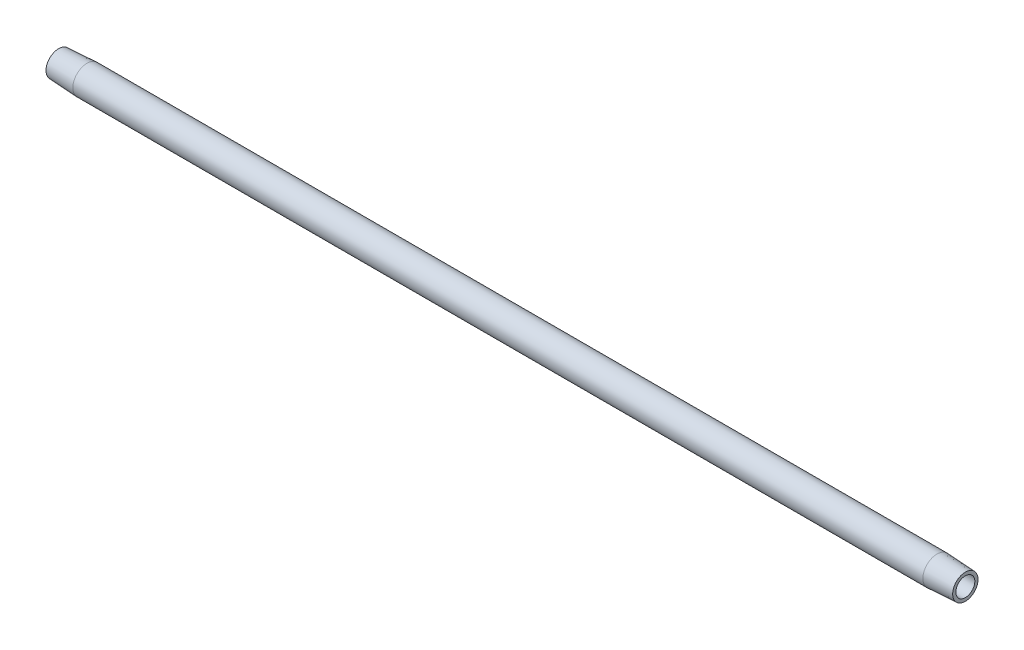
ISO-10303-21;
HEADER;
FILE_DESCRIPTION(('STEP AP214'),'2;1');
FILE_NAME('part.step','',(''),(''),'','','');
FILE_SCHEMA(('AUTOMOTIVE_DESIGN { 1 0 10303 214 1 1 1 1 }'));
ENDSEC;
DATA;
#1=APPLICATION_CONTEXT('core data for automotive mechanical design processes');
#2=APPLICATION_PROTOCOL_DEFINITION('international standard','automotive_design',2000,#1);
#3=PRODUCT_CONTEXT('',#1,'mechanical');
#4=PRODUCT('Part','Part','',(#3));
#5=PRODUCT_RELATED_PRODUCT_CATEGORY('part','',(#4));
#6=PRODUCT_DEFINITION_FORMATION('','',#4);
#7=PRODUCT_DEFINITION_CONTEXT('part definition',#1,'design');
#8=PRODUCT_DEFINITION('design','',#6,#7);
#9=PRODUCT_DEFINITION_SHAPE('','',#8);
#10=(LENGTH_UNIT() NAMED_UNIT(*) SI_UNIT(.MILLI.,.METRE.));
#11=(NAMED_UNIT(*) PLANE_ANGLE_UNIT() SI_UNIT($,.RADIAN.));
#12=(NAMED_UNIT(*) SI_UNIT($,.STERADIAN.) SOLID_ANGLE_UNIT());
#13=UNCERTAINTY_MEASURE_WITH_UNIT(LENGTH_MEASURE(1.E-05),#10,'distance_accuracy_value','');
#14=(GEOMETRIC_REPRESENTATION_CONTEXT(3) GLOBAL_UNCERTAINTY_ASSIGNED_CONTEXT((#13)) GLOBAL_UNIT_ASSIGNED_CONTEXT((#10,
#11,#12)) REPRESENTATION_CONTEXT('',''));
#15=CARTESIAN_POINT('',(0.,0.,0.));
#16=DIRECTION('',(0.,0.,1.));
#17=DIRECTION('',(1.,0.,0.));
#18=AXIS2_PLACEMENT_3D('',#15,#16,#17);
#19=CARTESIAN_POINT('',(0.476141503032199,0.,0.));
#20=DIRECTION('',(-1.,0.,0.));
#21=DIRECTION('',(0.,0.,1.));
#22=AXIS2_PLACEMENT_3D('',#19,#20,#21);
#23=CYLINDRICAL_SURFACE('',#22,3.96875);
#24=CARTESIAN_POINT('',(7.9375,0.,0.));
#25=DIRECTION('',(-1.,0.,0.));
#26=DIRECTION('',(0.,0.,1.));
#27=AXIS2_PLACEMENT_3D('',#24,#25,#26);
#28=CIRCLE('',#27,3.96875);
#29=CARTESIAN_POINT('',(7.9375,0.,3.96875));
#30=VERTEX_POINT('',#29);
#31=EDGE_CURVE('E10',#30,#30,#28,.T.);
#32=ORIENTED_EDGE('',*,*,#31,.F.);
#33=EDGE_LOOP('',(#32));
#34=FACE_BOUND('',#33,.T.);
#35=CARTESIAN_POINT('',(246.0625,0.,0.));
#36=DIRECTION('',(-1.,0.,0.));
#37=DIRECTION('',(0.,0.,1.));
#38=AXIS2_PLACEMENT_3D('',#35,#36,#37);
#39=CIRCLE('',#38,3.96875);
#40=CARTESIAN_POINT('',(246.0625,0.,3.96875));
#41=VERTEX_POINT('',#40);
#42=EDGE_CURVE('E52',#41,#41,#39,.T.);
#43=ORIENTED_EDGE('',*,*,#42,.T.);
#44=EDGE_LOOP('',(#43));
#45=FACE_BOUND('',#44,.T.);
#46=ADVANCED_FACE('F30',(#34,#45),#23,.T.);
#47=CARTESIAN_POINT('',(7.9375,0.,0.));
#48=DIRECTION('',(1.,0.,0.));
#49=DIRECTION('',(0.,0.,-1.));
#50=AXIS2_PLACEMENT_3D('',#47,#48,#49);
#51=CONICAL_SURFACE('',#50,3.96875,0.0523598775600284);
#52=CARTESIAN_POINT('',(0.,0.,0.));
#53=DIRECTION('',(-1.,0.,0.));
#54=DIRECTION('',(0.,0.,1.));
#55=AXIS2_PLACEMENT_3D('',#52,#53,#54);
#56=CIRCLE('',#55,3.55276325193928);
#57=CARTESIAN_POINT('',(0.,0.,3.55276325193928));
#58=VERTEX_POINT('',#57);
#59=EDGE_CURVE('E36',#58,#58,#56,.T.);
#60=ORIENTED_EDGE('',*,*,#59,.F.);
#61=EDGE_LOOP('',(#60));
#62=FACE_BOUND('',#61,.T.);
#63=ORIENTED_EDGE('',*,*,#31,.T.);
#64=EDGE_LOOP('',(#63));
#65=FACE_BOUND('',#64,.T.);
#66=ADVANCED_FACE('F77',(#62,#65),#51,.T.);
#67=CARTESIAN_POINT('',(0.,3.55276325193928,0.));
#68=DIRECTION('',(1.,0.,0.));
#69=DIRECTION('',(0.,0.,-1.));
#70=AXIS2_PLACEMENT_3D('',#67,#68,#69);
#71=PLANE('',#70);
#72=CARTESIAN_POINT('',(0.,0.,0.));
#73=DIRECTION('',(-1.,0.,0.));
#74=DIRECTION('',(0.,0.,1.));
#75=AXIS2_PLACEMENT_3D('',#72,#73,#74);
#76=CIRCLE('',#75,2.65429999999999);
#77=CARTESIAN_POINT('',(0.,0.,2.65429999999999));
#78=VERTEX_POINT('',#77);
#79=EDGE_CURVE('E40',#78,#78,#76,.T.);
#80=ORIENTED_EDGE('',*,*,#79,.F.);
#81=EDGE_LOOP('',(#80));
#82=FACE_BOUND('',#81,.T.);
#83=ORIENTED_EDGE('',*,*,#59,.T.);
#84=EDGE_LOOP('',(#83));
#85=FACE_BOUND('',#84,.T.);
#86=ADVANCED_FACE('F72',(#82,#85),#71,.F.);
#87=CARTESIAN_POINT('',(0.476141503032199,0.,0.));
#88=DIRECTION('',(-1.,0.,0.));
#89=DIRECTION('',(0.,0.,1.));
#90=AXIS2_PLACEMENT_3D('',#87,#88,#89);
#91=CYLINDRICAL_SURFACE('',#90,2.6543);
#92=CARTESIAN_POINT('',(254.,0.,0.));
#93=DIRECTION('',(-1.,0.,0.));
#94=DIRECTION('',(0.,0.,1.));
#95=AXIS2_PLACEMENT_3D('',#92,#93,#94);
#96=CIRCLE('',#95,2.6543);
#97=CARTESIAN_POINT('',(254.,0.,2.6543));
#98=VERTEX_POINT('',#97);
#99=EDGE_CURVE('E44',#98,#98,#96,.T.);
#100=ORIENTED_EDGE('',*,*,#99,.F.);
#101=EDGE_LOOP('',(#100));
#102=FACE_BOUND('',#101,.T.);
#103=ORIENTED_EDGE('',*,*,#79,.T.);
#104=EDGE_LOOP('',(#103));
#105=FACE_BOUND('',#104,.T.);
#106=ADVANCED_FACE('F66',(#102,#105),#91,.F.);
#107=CARTESIAN_POINT('',(254.,2.6543,0.));
#108=DIRECTION('',(-1.,0.,0.));
#109=DIRECTION('',(0.,0.,1.));
#110=AXIS2_PLACEMENT_3D('',#107,#108,#109);
#111=PLANE('',#110);
#112=CARTESIAN_POINT('',(254.,0.,0.));
#113=DIRECTION('',(-1.,0.,0.));
#114=DIRECTION('',(0.,0.,1.));
#115=AXIS2_PLACEMENT_3D('',#112,#113,#114);
#116=CIRCLE('',#115,3.55276325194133);
#117=CARTESIAN_POINT('',(254.,0.,3.55276325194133));
#118=VERTEX_POINT('',#117);
#119=EDGE_CURVE('E49',#118,#118,#116,.T.);
#120=ORIENTED_EDGE('',*,*,#119,.F.);
#121=EDGE_LOOP('',(#120));
#122=FACE_BOUND('',#121,.T.);
#123=ORIENTED_EDGE('',*,*,#99,.T.);
#124=EDGE_LOOP('',(#123));
#125=FACE_BOUND('',#124,.T.);
#126=ADVANCED_FACE('F60',(#122,#125),#111,.F.);
#127=CARTESIAN_POINT('',(254.,0.,0.));
#128=DIRECTION('',(-1.,0.,0.));
#129=DIRECTION('',(0.,0.,1.));
#130=AXIS2_PLACEMENT_3D('',#127,#128,#129);
#131=CONICAL_SURFACE('',#130,3.55276325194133,0.0523598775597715);
#132=ORIENTED_EDGE('',*,*,#42,.F.);
#133=EDGE_LOOP('',(#132));
#134=FACE_BOUND('',#133,.T.);
#135=ORIENTED_EDGE('',*,*,#119,.T.);
#136=EDGE_LOOP('',(#135));
#137=FACE_BOUND('',#136,.T.);
#138=ADVANCED_FACE('F57',(#134,#137),#131,.T.);
#139=CLOSED_SHELL('',(#46,#66,#86,#106,#126,#138));
#140=MANIFOLD_SOLID_BREP('B2',#139);
#141=ADVANCED_BREP_SHAPE_REPRESENTATION('',(#18,#140),#14);
#142=SHAPE_DEFINITION_REPRESENTATION(#9,#141);
ENDSEC;
END-ISO-10303-21;
